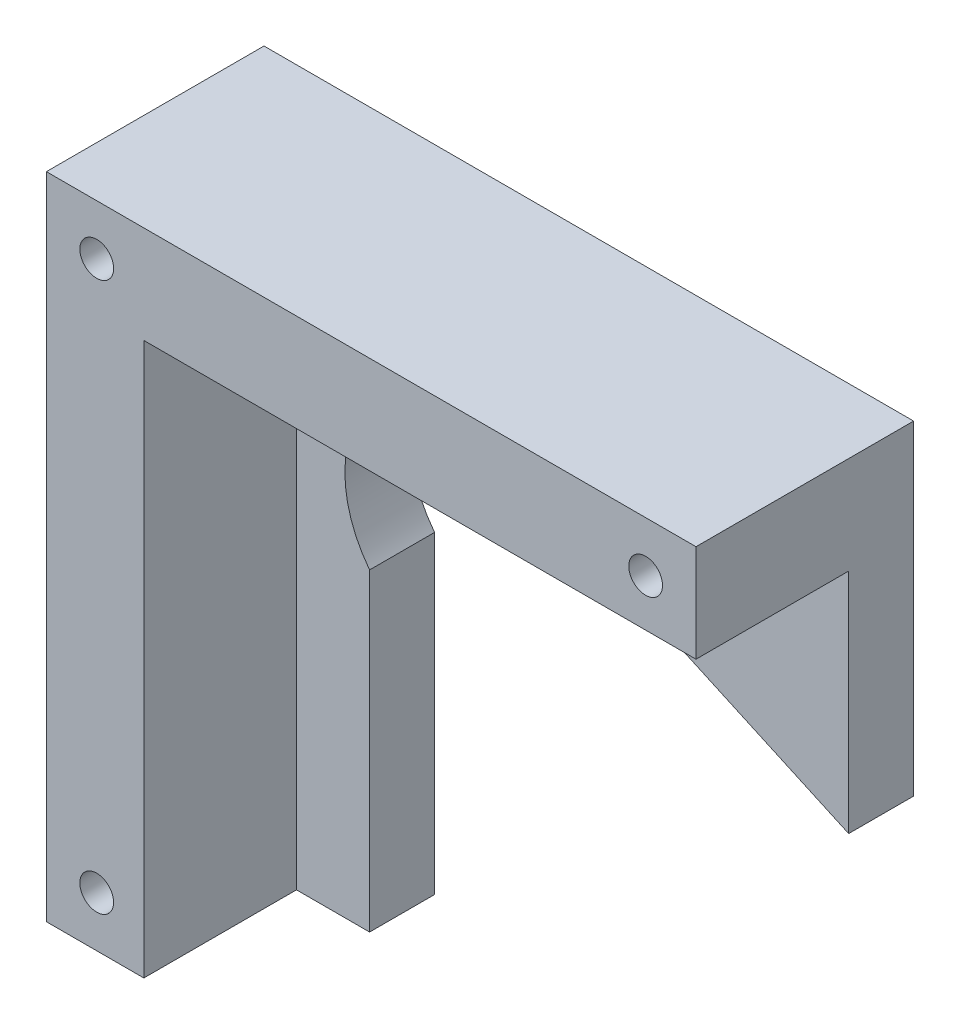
ISO-10303-21;
HEADER;
FILE_DESCRIPTION(('STEP AP214'),'2;1');
FILE_NAME('part.step','',(''),(''),'','','');
FILE_SCHEMA(('AUTOMOTIVE_DESIGN { 1 0 10303 214 1 1 1 1 }'));
ENDSEC;
DATA;
#1=APPLICATION_CONTEXT('core data for automotive mechanical design processes');
#2=APPLICATION_PROTOCOL_DEFINITION('international standard','automotive_design',2000,#1);
#3=PRODUCT_CONTEXT('',#1,'mechanical');
#4=PRODUCT('Part','Part','',(#3));
#5=PRODUCT_RELATED_PRODUCT_CATEGORY('part','',(#4));
#6=PRODUCT_DEFINITION_FORMATION('','',#4);
#7=PRODUCT_DEFINITION_CONTEXT('part definition',#1,'design');
#8=PRODUCT_DEFINITION('design','',#6,#7);
#9=PRODUCT_DEFINITION_SHAPE('','',#8);
#10=(LENGTH_UNIT() NAMED_UNIT(*) SI_UNIT(.MILLI.,.METRE.));
#11=(NAMED_UNIT(*) PLANE_ANGLE_UNIT() SI_UNIT($,.RADIAN.));
#12=(NAMED_UNIT(*) SI_UNIT($,.STERADIAN.) SOLID_ANGLE_UNIT());
#13=UNCERTAINTY_MEASURE_WITH_UNIT(LENGTH_MEASURE(1.E-05),#10,'distance_accuracy_value','');
#14=(GEOMETRIC_REPRESENTATION_CONTEXT(3) GLOBAL_UNCERTAINTY_ASSIGNED_CONTEXT((#13)) GLOBAL_UNIT_ASSIGNED_CONTEXT((#10,
#11,#12)) REPRESENTATION_CONTEXT('',''));
#15=CARTESIAN_POINT('',(0.,0.,0.));
#16=DIRECTION('',(0.,0.,1.));
#17=DIRECTION('',(1.,0.,0.));
#18=AXIS2_PLACEMENT_3D('',#15,#16,#17);
#19=CARTESIAN_POINT('',(-59.9893392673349,-70.1474851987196,33.5));
#20=DIRECTION('',(0.,1.,0.));
#21=DIRECTION('',(0.,0.,1.));
#22=AXIS2_PLACEMENT_3D('',#19,#20,#21);
#23=PLANE('',#22);
#24=DIRECTION('',(0.,0.,-1.));
#25=VECTOR('',#24,1.);
#26=CARTESIAN_POINT('',(-33.7351096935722,-70.1474851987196,40.));
#27=LINE('',#26,#25);
#28=CARTESIAN_POINT('',(-33.7351096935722,-70.1474851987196,10.));
#29=VERTEX_POINT('',#28);
#30=CARTESIAN_POINT('',(-33.7351096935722,-70.1474851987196,0.));
#31=VERTEX_POINT('',#30);
#32=EDGE_CURVE('E164',#29,#31,#27,.T.);
#33=ORIENTED_EDGE('',*,*,#32,.F.);
#34=DIRECTION('',(1.,0.,0.));
#35=VECTOR('',#34,1.);
#36=CARTESIAN_POINT('',(40.0106607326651,-70.1474851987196,10.));
#37=LINE('',#36,#35);
#38=CARTESIAN_POINT('',(-44.9893392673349,-70.1474851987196,10.));
#39=VERTEX_POINT('',#38);
#40=EDGE_CURVE('E190',#39,#29,#37,.T.);
#41=ORIENTED_EDGE('',*,*,#40,.F.);
#42=DIRECTION('',(0.,0.,1.));
#43=VECTOR('',#42,1.);
#44=CARTESIAN_POINT('',(-44.9893392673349,-70.1474851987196,10.));
#45=LINE('',#44,#43);
#46=CARTESIAN_POINT('',(-44.9893392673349,-70.1474851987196,33.5));
#47=VERTEX_POINT('',#46);
#48=EDGE_CURVE('E194',#39,#47,#45,.T.);
#49=ORIENTED_EDGE('',*,*,#48,.T.);
#50=DIRECTION('',(1.,0.,0.));
#51=VECTOR('',#50,1.);
#52=CARTESIAN_POINT('',(-59.9893392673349,-70.1474851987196,33.5));
#53=LINE('',#52,#51);
#54=CARTESIAN_POINT('',(-59.9893392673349,-70.1474851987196,33.5));
#55=VERTEX_POINT('',#54);
#56=EDGE_CURVE('E202',#55,#47,#53,.T.);
#57=ORIENTED_EDGE('',*,*,#56,.F.);
#58=DIRECTION('',(0.,0.,-1.));
#59=VECTOR('',#58,1.);
#60=CARTESIAN_POINT('',(-59.9893392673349,-70.1474851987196,33.5));
#61=LINE('',#60,#59);
#62=CARTESIAN_POINT('',(-59.9893392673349,-70.1474851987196,0.));
#63=VERTEX_POINT('',#62);
#64=EDGE_CURVE('E152',#55,#63,#61,.T.);
#65=ORIENTED_EDGE('',*,*,#64,.T.);
#66=DIRECTION('',(1.,0.,0.));
#67=VECTOR('',#66,1.);
#68=CARTESIAN_POINT('',(-59.9893392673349,-70.1474851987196,0.));
#69=LINE('',#68,#67);
#70=EDGE_CURVE('E137',#63,#31,#69,.T.);
#71=ORIENTED_EDGE('',*,*,#70,.T.);
#72=EDGE_LOOP('',(#33,#41,#49,#57,#65,#71));
#73=FACE_BOUND('',#72,.T.);
#74=ADVANCED_FACE('F33',(#73),#23,.F.);
#75=CARTESIAN_POINT('',(40.0106607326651,29.8525148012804,33.5));
#76=DIRECTION('',(-1.,0.,0.));
#77=DIRECTION('',(0.,-1.,0.));
#78=AXIS2_PLACEMENT_3D('',#75,#76,#77);
#79=PLANE('',#78);
#80=DIRECTION('',(0.,0.,-1.));
#81=VECTOR('',#80,1.);
#82=CARTESIAN_POINT('',(40.0106607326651,-20.1474851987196,40.));
#83=LINE('',#82,#81);
#84=CARTESIAN_POINT('',(40.0106607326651,-20.1474851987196,10.));
#85=VERTEX_POINT('',#84);
#86=CARTESIAN_POINT('',(40.0106607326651,-20.1474851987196,0.));
#87=VERTEX_POINT('',#86);
#88=EDGE_CURVE('E114',#85,#87,#83,.T.);
#89=ORIENTED_EDGE('',*,*,#88,.T.);
#90=DIRECTION('',(0.,1.,0.));
#91=VECTOR('',#90,1.);
#92=CARTESIAN_POINT('',(40.0106607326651,29.8525148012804,0.));
#93=LINE('',#92,#91);
#94=CARTESIAN_POINT('',(40.0106607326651,29.8525148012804,0.));
#95=VERTEX_POINT('',#94);
#96=EDGE_CURVE('E127',#87,#95,#93,.T.);
#97=ORIENTED_EDGE('',*,*,#96,.T.);
#98=DIRECTION('',(0.,0.,-1.));
#99=VECTOR('',#98,1.);
#100=CARTESIAN_POINT('',(40.0106607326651,29.8525148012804,33.5));
#101=LINE('',#100,#99);
#102=CARTESIAN_POINT('',(40.0106607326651,29.8525148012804,33.5));
#103=VERTEX_POINT('',#102);
#104=EDGE_CURVE('E149',#103,#95,#101,.T.);
#105=ORIENTED_EDGE('',*,*,#104,.F.);
#106=DIRECTION('',(0.,1.,0.));
#107=VECTOR('',#106,1.);
#108=CARTESIAN_POINT('',(40.0106607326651,29.8525148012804,33.5));
#109=LINE('',#108,#107);
#110=CARTESIAN_POINT('',(40.0106607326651,14.8525148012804,33.5));
#111=VERTEX_POINT('',#110);
#112=EDGE_CURVE('E205',#111,#103,#109,.T.);
#113=ORIENTED_EDGE('',*,*,#112,.F.);
#114=DIRECTION('',(0.,0.,1.));
#115=VECTOR('',#114,1.);
#116=CARTESIAN_POINT('',(40.0106607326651,14.8525148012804,10.));
#117=LINE('',#116,#115);
#118=CARTESIAN_POINT('',(40.0106607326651,14.8525148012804,10.));
#119=VERTEX_POINT('',#118);
#120=EDGE_CURVE('E56',#119,#111,#117,.T.);
#121=ORIENTED_EDGE('',*,*,#120,.F.);
#122=DIRECTION('',(0.,1.,0.));
#123=VECTOR('',#122,1.);
#124=CARTESIAN_POINT('',(40.0106607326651,-70.1474851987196,10.));
#125=LINE('',#124,#123);
#126=EDGE_CURVE('E129',#85,#119,#125,.T.);
#127=ORIENTED_EDGE('',*,*,#126,.F.);
#128=EDGE_LOOP('',(#89,#97,#105,#113,#121,#127));
#129=FACE_BOUND('',#128,.T.);
#130=ADVANCED_FACE('F125',(#129),#79,.F.);
#131=CARTESIAN_POINT('',(0.,0.,10.));
#132=DIRECTION('',(0.,0.,1.));
#133=DIRECTION('',(1.,0.,0.));
#134=AXIS2_PLACEMENT_3D('',#131,#132,#133);
#135=PLANE('',#134);
#136=CARTESIAN_POINT('',(-19.3893392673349,-10.7474851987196,10.));
#137=DIRECTION('',(0.,0.,1.));
#138=DIRECTION('',(1.,0.,0.));
#139=AXIS2_PLACEMENT_3D('',#136,#137,#138);
#140=CIRCLE('',#139,18.15);
#141=CARTESIAN_POINT('',(-33.7351096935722,-21.8659999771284,10.));
#142=VERTEX_POINT('',#141);
#143=CARTESIAN_POINT('',(-5.0435688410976,0.371029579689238,10.));
#144=VERTEX_POINT('',#143);
#145=EDGE_CURVE('E41',#142,#144,#140,.F.);
#146=ORIENTED_EDGE('',*,*,#145,.T.);
#147=DIRECTION('',(0.910067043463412,-0.414461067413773,0.));
#148=VECTOR('',#147,1.);
#149=CARTESIAN_POINT('',(-0.726426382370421,-1.59507553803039,10.));
#150=LINE('',#149,#148);
#151=EDGE_CURVE('E11',#144,#85,#150,.T.);
#152=ORIENTED_EDGE('',*,*,#151,.T.);
#153=ORIENTED_EDGE('',*,*,#126,.T.);
#154=DIRECTION('',(-1.,0.,0.));
#155=VECTOR('',#154,1.);
#156=CARTESIAN_POINT('',(40.0106607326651,14.8525148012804,10.));
#157=LINE('',#156,#155);
#158=CARTESIAN_POINT('',(-44.9893392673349,14.8525148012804,10.));
#159=VERTEX_POINT('',#158);
#160=EDGE_CURVE('E183',#119,#159,#157,.T.);
#161=ORIENTED_EDGE('',*,*,#160,.T.);
#162=DIRECTION('',(0.,-1.,0.));
#163=VECTOR('',#162,1.);
#164=CARTESIAN_POINT('',(-44.9893392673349,-70.1474851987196,10.));
#165=LINE('',#164,#163);
#166=EDGE_CURVE('E187',#159,#39,#165,.T.);
#167=ORIENTED_EDGE('',*,*,#166,.T.);
#168=ORIENTED_EDGE('',*,*,#40,.T.);
#169=DIRECTION('',(0.,1.,0.));
#170=VECTOR('',#169,1.);
#171=CARTESIAN_POINT('',(-33.7351096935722,0.,10.));
#172=LINE('',#171,#170);
#173=EDGE_CURVE('E155',#29,#142,#172,.T.);
#174=ORIENTED_EDGE('',*,*,#173,.T.);
#175=EDGE_LOOP('',(#146,#152,#153,#161,#167,#168,#174));
#176=FACE_BOUND('',#175,.T.);
#177=ADVANCED_FACE('F159',(#176),#135,.T.);
#178=CARTESIAN_POINT('',(-59.9893392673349,29.8525148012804,33.5));
#179=DIRECTION('',(1.,0.,0.));
#180=DIRECTION('',(0.,1.,0.));
#181=AXIS2_PLACEMENT_3D('',#178,#179,#180);
#182=PLANE('',#181);
#183=DIRECTION('',(0.,-1.,0.));
#184=VECTOR('',#183,1.);
#185=CARTESIAN_POINT('',(-59.9893392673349,29.8525148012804,0.));
#186=LINE('',#185,#184);
#187=CARTESIAN_POINT('',(-59.9893392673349,29.8525148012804,0.));
#188=VERTEX_POINT('',#187);
#189=EDGE_CURVE('E142',#188,#63,#186,.T.);
#190=ORIENTED_EDGE('',*,*,#189,.T.);
#191=ORIENTED_EDGE('',*,*,#64,.F.);
#192=DIRECTION('',(0.,-1.,0.));
#193=VECTOR('',#192,1.);
#194=CARTESIAN_POINT('',(-59.9893392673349,29.8525148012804,33.5));
#195=LINE('',#194,#193);
#196=CARTESIAN_POINT('',(-59.9893392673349,29.8525148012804,33.5));
#197=VERTEX_POINT('',#196);
#198=EDGE_CURVE('E139',#197,#55,#195,.T.);
#199=ORIENTED_EDGE('',*,*,#198,.F.);
#200=DIRECTION('',(0.,0.,-1.));
#201=VECTOR('',#200,1.);
#202=CARTESIAN_POINT('',(-59.9893392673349,29.8525148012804,33.5));
#203=LINE('',#202,#201);
#204=EDGE_CURVE('E146',#197,#188,#203,.T.);
#205=ORIENTED_EDGE('',*,*,#204,.T.);
#206=EDGE_LOOP('',(#190,#191,#199,#205));
#207=FACE_BOUND('',#206,.T.);
#208=ADVANCED_FACE('F35',(#207),#182,.F.);
#209=CARTESIAN_POINT('',(-59.9893392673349,29.8525148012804,33.5));
#210=DIRECTION('',(0.,-1.,0.));
#211=DIRECTION('',(0.,0.,-1.));
#212=AXIS2_PLACEMENT_3D('',#209,#210,#211);
#213=PLANE('',#212);
#214=DIRECTION('',(-1.,0.,0.));
#215=VECTOR('',#214,1.);
#216=CARTESIAN_POINT('',(-59.9893392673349,29.8525148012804,0.));
#217=LINE('',#216,#215);
#218=EDGE_CURVE('E136',#95,#188,#217,.T.);
#219=ORIENTED_EDGE('',*,*,#218,.T.);
#220=ORIENTED_EDGE('',*,*,#204,.F.);
#221=DIRECTION('',(-1.,0.,0.));
#222=VECTOR('',#221,1.);
#223=CARTESIAN_POINT('',(-59.9893392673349,29.8525148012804,33.5));
#224=LINE('',#223,#222);
#225=EDGE_CURVE('E150',#103,#197,#224,.T.);
#226=ORIENTED_EDGE('',*,*,#225,.F.);
#227=ORIENTED_EDGE('',*,*,#104,.T.);
#228=EDGE_LOOP('',(#219,#220,#226,#227));
#229=FACE_BOUND('',#228,.T.);
#230=ADVANCED_FACE('F223',(#229),#213,.F.);
#231=CARTESIAN_POINT('',(0.,0.,33.5));
#232=DIRECTION('',(0.,0.,1.));
#233=DIRECTION('',(1.,0.,0.));
#234=AXIS2_PLACEMENT_3D('',#231,#232,#233);
#235=PLANE('',#234);
#236=CARTESIAN_POINT('',(-52.2393392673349,22.1025148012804,33.5));
#237=DIRECTION('',(0.,0.,1.));
#238=DIRECTION('',(1.,0.,0.));
#239=AXIS2_PLACEMENT_3D('',#236,#237,#238);
#240=CIRCLE('',#239,2.6);
#241=CARTESIAN_POINT('',(-49.6393392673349,22.1025148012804,33.5));
#242=VERTEX_POINT('',#241);
#243=EDGE_CURVE('E178',#242,#242,#240,.F.);
#244=ORIENTED_EDGE('',*,*,#243,.T.);
#245=EDGE_LOOP('',(#244));
#246=FACE_BOUND('',#245,.T.);
#247=CARTESIAN_POINT('',(-52.2393392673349,-62.3974851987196,33.5));
#248=DIRECTION('',(0.,0.,1.));
#249=DIRECTION('',(1.,0.,0.));
#250=AXIS2_PLACEMENT_3D('',#247,#248,#249);
#251=CIRCLE('',#250,2.6);
#252=CARTESIAN_POINT('',(-49.6393392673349,-62.3974851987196,33.5));
#253=VERTEX_POINT('',#252);
#254=EDGE_CURVE('E175',#253,#253,#251,.F.);
#255=ORIENTED_EDGE('',*,*,#254,.T.);
#256=EDGE_LOOP('',(#255));
#257=FACE_BOUND('',#256,.T.);
#258=CARTESIAN_POINT('',(32.2606607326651,22.1025148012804,33.5));
#259=DIRECTION('',(0.,0.,1.));
#260=DIRECTION('',(1.,0.,0.));
#261=AXIS2_PLACEMENT_3D('',#258,#259,#260);
#262=CIRCLE('',#261,2.6);
#263=CARTESIAN_POINT('',(34.8606607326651,22.1025148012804,33.5));
#264=VERTEX_POINT('',#263);
#265=EDGE_CURVE('E171',#264,#264,#262,.F.);
#266=ORIENTED_EDGE('',*,*,#265,.T.);
#267=EDGE_LOOP('',(#266));
#268=FACE_BOUND('',#267,.T.);
#269=DIRECTION('',(0.,-1.,0.));
#270=VECTOR('',#269,1.);
#271=CARTESIAN_POINT('',(-44.9893392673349,-70.1474851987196,33.5));
#272=LINE('',#271,#270);
#273=CARTESIAN_POINT('',(-44.9893392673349,14.8525148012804,33.5));
#274=VERTEX_POINT('',#273);
#275=EDGE_CURVE('E184',#274,#47,#272,.T.);
#276=ORIENTED_EDGE('',*,*,#275,.F.);
#277=DIRECTION('',(-1.,0.,0.));
#278=VECTOR('',#277,1.);
#279=CARTESIAN_POINT('',(40.0106607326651,14.8525148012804,33.5));
#280=LINE('',#279,#278);
#281=EDGE_CURVE('E181',#111,#274,#280,.T.);
#282=ORIENTED_EDGE('',*,*,#281,.F.);
#283=ORIENTED_EDGE('',*,*,#112,.T.);
#284=ORIENTED_EDGE('',*,*,#225,.T.);
#285=ORIENTED_EDGE('',*,*,#198,.T.);
#286=ORIENTED_EDGE('',*,*,#56,.T.);
#287=EDGE_LOOP('',(#276,#282,#283,#284,#285,#286));
#288=FACE_BOUND('',#287,.T.);
#289=ADVANCED_FACE('F219',(#246,#257,#268,#288),#235,.T.);
#290=CARTESIAN_POINT('',(0.,0.,0.));
#291=DIRECTION('',(0.,0.,1.));
#292=DIRECTION('',(1.,0.,0.));
#293=AXIS2_PLACEMENT_3D('',#290,#291,#292);
#294=PLANE('',#293);
#295=DIRECTION('',(-0.910067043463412,0.414461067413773,0.));
#296=VECTOR('',#295,1.);
#297=CARTESIAN_POINT('',(40.0106607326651,-20.1474851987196,0.));
#298=LINE('',#297,#296);
#299=CARTESIAN_POINT('',(-5.0435688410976,0.371029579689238,0.));
#300=VERTEX_POINT('',#299);
#301=EDGE_CURVE('E111',#87,#300,#298,.T.);
#302=ORIENTED_EDGE('',*,*,#301,.T.);
#303=CARTESIAN_POINT('',(-19.3893392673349,-10.7474851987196,0.));
#304=DIRECTION('',(0.,0.,1.));
#305=DIRECTION('',(-1.,0.,0.));
#306=AXIS2_PLACEMENT_3D('',#303,#304,#305);
#307=CIRCLE('',#306,18.15);
#308=CARTESIAN_POINT('',(-33.7351096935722,-21.8659999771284,0.));
#309=VERTEX_POINT('',#308);
#310=EDGE_CURVE('E121',#300,#309,#307,.T.);
#311=ORIENTED_EDGE('',*,*,#310,.T.);
#312=DIRECTION('',(0.,-1.,0.));
#313=VECTOR('',#312,1.);
#314=CARTESIAN_POINT('',(-33.7351096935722,-21.8659999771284,0.));
#315=LINE('',#314,#313);
#316=EDGE_CURVE('E213',#309,#31,#315,.T.);
#317=ORIENTED_EDGE('',*,*,#316,.T.);
#318=ORIENTED_EDGE('',*,*,#70,.F.);
#319=ORIENTED_EDGE('',*,*,#189,.F.);
#320=ORIENTED_EDGE('',*,*,#218,.F.);
#321=ORIENTED_EDGE('',*,*,#96,.F.);
#322=EDGE_LOOP('',(#302,#311,#317,#318,#319,#320,#321));
#323=FACE_BOUND('',#322,.T.);
#324=CARTESIAN_POINT('',(-52.2393392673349,22.1025148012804,0.));
#325=DIRECTION('',(0.,0.,1.));
#326=DIRECTION('',(1.,0.,0.));
#327=AXIS2_PLACEMENT_3D('',#324,#325,#326);
#328=CIRCLE('',#327,2.6);
#329=CARTESIAN_POINT('',(-49.6393392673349,22.1025148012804,0.));
#330=VERTEX_POINT('',#329);
#331=EDGE_CURVE('E130',#330,#330,#328,.T.);
#332=ORIENTED_EDGE('',*,*,#331,.T.);
#333=EDGE_LOOP('',(#332));
#334=FACE_BOUND('',#333,.T.);
#335=CARTESIAN_POINT('',(-52.2393392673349,-62.3974851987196,0.));
#336=DIRECTION('',(0.,0.,1.));
#337=DIRECTION('',(1.,0.,0.));
#338=AXIS2_PLACEMENT_3D('',#335,#336,#337);
#339=CIRCLE('',#338,2.6);
#340=CARTESIAN_POINT('',(-49.6393392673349,-62.3974851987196,0.));
#341=VERTEX_POINT('',#340);
#342=EDGE_CURVE('E172',#341,#341,#339,.T.);
#343=ORIENTED_EDGE('',*,*,#342,.T.);
#344=EDGE_LOOP('',(#343));
#345=FACE_BOUND('',#344,.T.);
#346=CARTESIAN_POINT('',(32.2606607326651,22.1025148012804,0.));
#347=DIRECTION('',(0.,0.,1.));
#348=DIRECTION('',(1.,0.,0.));
#349=AXIS2_PLACEMENT_3D('',#346,#347,#348);
#350=CIRCLE('',#349,2.6);
#351=CARTESIAN_POINT('',(34.8606607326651,22.1025148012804,0.));
#352=VERTEX_POINT('',#351);
#353=EDGE_CURVE('E168',#352,#352,#350,.T.);
#354=ORIENTED_EDGE('',*,*,#353,.T.);
#355=EDGE_LOOP('',(#354));
#356=FACE_BOUND('',#355,.T.);
#357=ADVANCED_FACE('F133',(#323,#334,#345,#356),#294,.F.);
#358=CARTESIAN_POINT('',(-44.9893392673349,-70.1474851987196,10.));
#359=DIRECTION('',(-1.,0.,0.));
#360=DIRECTION('',(0.,0.,1.));
#361=AXIS2_PLACEMENT_3D('',#358,#359,#360);
#362=PLANE('',#361);
#363=ORIENTED_EDGE('',*,*,#275,.T.);
#364=ORIENTED_EDGE('',*,*,#48,.F.);
#365=ORIENTED_EDGE('',*,*,#166,.F.);
#366=DIRECTION('',(0.,0.,1.));
#367=VECTOR('',#366,1.);
#368=CARTESIAN_POINT('',(-44.9893392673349,14.8525148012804,10.));
#369=LINE('',#368,#367);
#370=EDGE_CURVE('E197',#159,#274,#369,.T.);
#371=ORIENTED_EDGE('',*,*,#370,.T.);
#372=EDGE_LOOP('',(#363,#364,#365,#371));
#373=FACE_BOUND('',#372,.T.);
#374=ADVANCED_FACE('F248',(#373),#362,.F.);
#375=CARTESIAN_POINT('',(40.0106607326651,14.8525148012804,10.));
#376=DIRECTION('',(0.,1.,0.));
#377=DIRECTION('',(-1.,0.,0.));
#378=AXIS2_PLACEMENT_3D('',#375,#376,#377);
#379=PLANE('',#378);
#380=ORIENTED_EDGE('',*,*,#281,.T.);
#381=ORIENTED_EDGE('',*,*,#370,.F.);
#382=ORIENTED_EDGE('',*,*,#160,.F.);
#383=ORIENTED_EDGE('',*,*,#120,.T.);
#384=EDGE_LOOP('',(#380,#381,#382,#383));
#385=FACE_BOUND('',#384,.T.);
#386=ADVANCED_FACE('F251',(#385),#379,.F.);
#387=CARTESIAN_POINT('',(40.0106607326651,-20.1474851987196,40.));
#388=DIRECTION('',(-0.414461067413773,-0.910067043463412,0.));
#389=DIRECTION('',(0.910067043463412,-0.414461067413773,0.));
#390=AXIS2_PLACEMENT_3D('',#387,#388,#389);
#391=PLANE('',#390);
#392=DIRECTION('',(0.,0.,-1.));
#393=VECTOR('',#392,1.);
#394=CARTESIAN_POINT('',(-5.0435688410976,0.371029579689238,40.));
#395=LINE('',#394,#393);
#396=EDGE_CURVE('E116',#144,#300,#395,.T.);
#397=ORIENTED_EDGE('',*,*,#396,.T.);
#398=ORIENTED_EDGE('',*,*,#301,.F.);
#399=ORIENTED_EDGE('',*,*,#88,.F.);
#400=ORIENTED_EDGE('',*,*,#151,.F.);
#401=EDGE_LOOP('',(#397,#398,#399,#400));
#402=FACE_BOUND('',#401,.T.);
#403=ADVANCED_FACE('F113',(#402),#391,.T.);
#404=CARTESIAN_POINT('',(-19.3893392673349,-10.7474851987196,40.));
#405=DIRECTION('',(0.,0.,-1.));
#406=DIRECTION('',(-1.,0.,0.));
#407=AXIS2_PLACEMENT_3D('',#404,#405,#406);
#408=CYLINDRICAL_SURFACE('',#407,18.15);
#409=DIRECTION('',(0.,0.,-1.));
#410=VECTOR('',#409,1.);
#411=CARTESIAN_POINT('',(-33.7351096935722,-21.8659999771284,40.));
#412=LINE('',#411,#410);
#413=EDGE_CURVE('E48',#142,#309,#412,.T.);
#414=ORIENTED_EDGE('',*,*,#413,.T.);
#415=ORIENTED_EDGE('',*,*,#310,.F.);
#416=ORIENTED_EDGE('',*,*,#396,.F.);
#417=ORIENTED_EDGE('',*,*,#145,.F.);
#418=EDGE_LOOP('',(#414,#415,#416,#417));
#419=FACE_BOUND('',#418,.T.);
#420=ADVANCED_FACE('F162',(#419),#408,.F.);
#421=CARTESIAN_POINT('',(-33.7351096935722,-21.8659999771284,40.));
#422=DIRECTION('',(1.,0.,0.));
#423=DIRECTION('',(0.,0.,-1.));
#424=AXIS2_PLACEMENT_3D('',#421,#422,#423);
#425=PLANE('',#424);
#426=ORIENTED_EDGE('',*,*,#32,.T.);
#427=ORIENTED_EDGE('',*,*,#316,.F.);
#428=ORIENTED_EDGE('',*,*,#413,.F.);
#429=ORIENTED_EDGE('',*,*,#173,.F.);
#430=EDGE_LOOP('',(#426,#427,#428,#429));
#431=FACE_BOUND('',#430,.T.);
#432=ADVANCED_FACE('F278',(#431),#425,.T.);
#433=CARTESIAN_POINT('',(32.2606607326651,22.1025148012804,40.));
#434=DIRECTION('',(0.,0.,-1.));
#435=DIRECTION('',(-1.,0.,0.));
#436=AXIS2_PLACEMENT_3D('',#433,#434,#435);
#437=CYLINDRICAL_SURFACE('',#436,2.6);
#438=ORIENTED_EDGE('',*,*,#265,.F.);
#439=EDGE_LOOP('',(#438));
#440=FACE_BOUND('',#439,.T.);
#441=ORIENTED_EDGE('',*,*,#353,.F.);
#442=EDGE_LOOP('',(#441));
#443=FACE_BOUND('',#442,.T.);
#444=ADVANCED_FACE('F246',(#440,#443),#437,.F.);
#445=CARTESIAN_POINT('',(-52.2393392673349,-62.3974851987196,40.));
#446=DIRECTION('',(0.,0.,-1.));
#447=DIRECTION('',(-1.,0.,0.));
#448=AXIS2_PLACEMENT_3D('',#445,#446,#447);
#449=CYLINDRICAL_SURFACE('',#448,2.6);
#450=ORIENTED_EDGE('',*,*,#254,.F.);
#451=EDGE_LOOP('',(#450));
#452=FACE_BOUND('',#451,.T.);
#453=ORIENTED_EDGE('',*,*,#342,.F.);
#454=EDGE_LOOP('',(#453));
#455=FACE_BOUND('',#454,.T.);
#456=ADVANCED_FACE('F291',(#452,#455),#449,.F.);
#457=CARTESIAN_POINT('',(-52.2393392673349,22.1025148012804,40.));
#458=DIRECTION('',(0.,0.,-1.));
#459=DIRECTION('',(-1.,0.,0.));
#460=AXIS2_PLACEMENT_3D('',#457,#458,#459);
#461=CYLINDRICAL_SURFACE('',#460,2.6);
#462=ORIENTED_EDGE('',*,*,#243,.F.);
#463=EDGE_LOOP('',(#462));
#464=FACE_BOUND('',#463,.T.);
#465=ORIENTED_EDGE('',*,*,#331,.F.);
#466=EDGE_LOOP('',(#465));
#467=FACE_BOUND('',#466,.T.);
#468=ADVANCED_FACE('F298',(#464,#467),#461,.F.);
#469=CLOSED_SHELL('',(#74,#130,#177,#208,#230,#289,#357,#374,#386,#403,#420,#432,#444,#456,#468));
#470=MANIFOLD_SOLID_BREP('B2',#469);
#471=ADVANCED_BREP_SHAPE_REPRESENTATION('',(#18,#470),#14);
#472=SHAPE_DEFINITION_REPRESENTATION(#9,#471);
ENDSEC;
END-ISO-10303-21;
